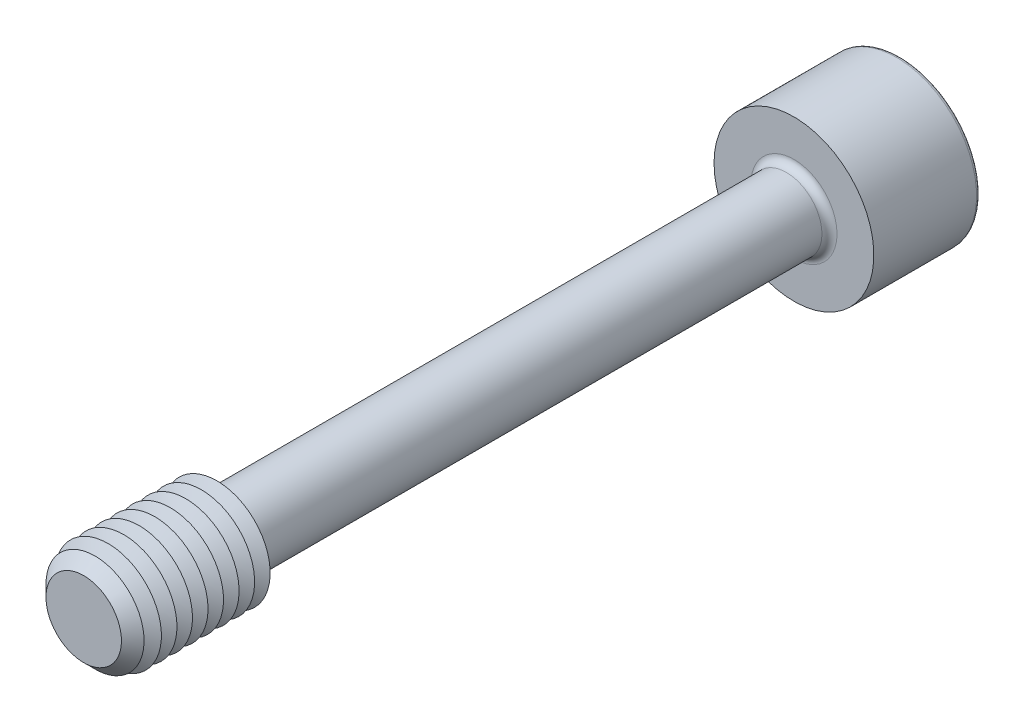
ISO-10303-21;
HEADER;
FILE_DESCRIPTION(('STEP AP214'),'2;1');
FILE_NAME('part.step','',(''),(''),'','','');
FILE_SCHEMA(('AUTOMOTIVE_DESIGN { 1 0 10303 214 1 1 1 1 }'));
ENDSEC;
DATA;
#1=APPLICATION_CONTEXT('core data for automotive mechanical design processes');
#2=APPLICATION_PROTOCOL_DEFINITION('international standard','automotive_design',2000,#1);
#3=PRODUCT_CONTEXT('',#1,'mechanical');
#4=PRODUCT('Part','Part','',(#3));
#5=PRODUCT_RELATED_PRODUCT_CATEGORY('part','',(#4));
#6=PRODUCT_DEFINITION_FORMATION('','',#4);
#7=PRODUCT_DEFINITION_CONTEXT('part definition',#1,'design');
#8=PRODUCT_DEFINITION('design','',#6,#7);
#9=PRODUCT_DEFINITION_SHAPE('','',#8);
#10=(LENGTH_UNIT() NAMED_UNIT(*) SI_UNIT(.MILLI.,.METRE.));
#11=(NAMED_UNIT(*) PLANE_ANGLE_UNIT() SI_UNIT($,.RADIAN.));
#12=(NAMED_UNIT(*) SI_UNIT($,.STERADIAN.) SOLID_ANGLE_UNIT());
#13=UNCERTAINTY_MEASURE_WITH_UNIT(LENGTH_MEASURE(1.E-05),#10,'distance_accuracy_value','');
#14=(GEOMETRIC_REPRESENTATION_CONTEXT(3) GLOBAL_UNCERTAINTY_ASSIGNED_CONTEXT((#13)) GLOBAL_UNIT_ASSIGNED_CONTEXT((#10,
#11,#12)) REPRESENTATION_CONTEXT('',''));
#15=CARTESIAN_POINT('',(0.,0.,0.));
#16=DIRECTION('',(0.,0.,1.));
#17=DIRECTION('',(1.,0.,0.));
#18=AXIS2_PLACEMENT_3D('',#15,#16,#17);
#19=CARTESIAN_POINT('',(-2.88675134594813,-5.,-42.));
#20=DIRECTION('',(0.,0.,1.));
#21=DIRECTION('',(1.,0.,0.));
#22=AXIS2_PLACEMENT_3D('',#19,#20,#21);
#23=PLANE('',#22);
#24=DIRECTION('',(1.,0.,0.));
#25=VECTOR('',#24,1.);
#26=CARTESIAN_POINT('',(-2.88675134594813,-5.,-42.));
#27=LINE('',#26,#25);
#28=CARTESIAN_POINT('',(0.,-5.,-42.));
#29=VERTEX_POINT('',#28);
#30=CARTESIAN_POINT('',(2.88675134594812,-5.,-42.));
#31=VERTEX_POINT('',#30);
#32=EDGE_CURVE('E763',#29,#31,#27,.T.);
#33=ORIENTED_EDGE('',*,*,#32,.F.);
#34=CARTESIAN_POINT('',(0.,0.,-42.));
#35=DIRECTION('',(0.,0.,1.));
#36=DIRECTION('',(0.,-1.,0.));
#37=AXIS2_PLACEMENT_3D('',#34,#35,#36);
#38=CIRCLE('',#37,5.);
#39=CARTESIAN_POINT('',(4.3301270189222,-2.5,-42.));
#40=VERTEX_POINT('',#39);
#41=EDGE_CURVE('E53',#29,#40,#38,.T.);
#42=ORIENTED_EDGE('',*,*,#41,.T.);
#43=DIRECTION('',(0.5,0.866025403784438,0.));
#44=VECTOR('',#43,1.);
#45=CARTESIAN_POINT('',(2.88675134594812,-5.,-42.));
#46=LINE('',#45,#44);
#47=EDGE_CURVE('E750',#31,#40,#46,.T.);
#48=ORIENTED_EDGE('',*,*,#47,.F.);
#49=EDGE_LOOP('',(#33,#42,#48));
#50=FACE_BOUND('',#49,.T.);
#51=ADVANCED_FACE('F41',(#50),#23,.F.);
#52=CARTESIAN_POINT('',(5.77350269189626,0.,-42.));
#53=VERTEX_POINT('',#52);
#54=EDGE_CURVE('E759',#40,#53,#46,.T.);
#55=ORIENTED_EDGE('',*,*,#54,.F.);
#56=CARTESIAN_POINT('',(4.3301270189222,2.50000000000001,-42.));
#57=VERTEX_POINT('',#56);
#58=EDGE_CURVE('E11',#40,#57,#38,.T.);
#59=ORIENTED_EDGE('',*,*,#58,.T.);
#60=DIRECTION('',(-0.5,0.866025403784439,0.));
#61=VECTOR('',#60,1.);
#62=CARTESIAN_POINT('',(5.77350269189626,0.,-42.));
#63=LINE('',#62,#61);
#64=EDGE_CURVE('E749',#53,#57,#63,.T.);
#65=ORIENTED_EDGE('',*,*,#64,.F.);
#66=EDGE_LOOP('',(#55,#59,#65));
#67=FACE_BOUND('',#66,.T.);
#68=ADVANCED_FACE('F133',(#67),#23,.F.);
#69=CARTESIAN_POINT('',(2.88675134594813,5.,-42.));
#70=VERTEX_POINT('',#69);
#71=EDGE_CURVE('E744',#57,#70,#63,.T.);
#72=ORIENTED_EDGE('',*,*,#71,.F.);
#73=CARTESIAN_POINT('',(0.,5.00000000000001,-42.));
#74=VERTEX_POINT('',#73);
#75=EDGE_CURVE('E51',#57,#74,#38,.T.);
#76=ORIENTED_EDGE('',*,*,#75,.T.);
#77=DIRECTION('',(-1.,0.,0.));
#78=VECTOR('',#77,1.);
#79=CARTESIAN_POINT('',(2.88675134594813,5.,-42.));
#80=LINE('',#79,#78);
#81=EDGE_CURVE('E177',#70,#74,#80,.T.);
#82=ORIENTED_EDGE('',*,*,#81,.F.);
#83=EDGE_LOOP('',(#72,#76,#82));
#84=FACE_BOUND('',#83,.T.);
#85=ADVANCED_FACE('F139',(#84),#23,.F.);
#86=CARTESIAN_POINT('',(-2.88675134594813,5.,-42.));
#87=VERTEX_POINT('',#86);
#88=EDGE_CURVE('E754',#74,#87,#80,.T.);
#89=ORIENTED_EDGE('',*,*,#88,.F.);
#90=CARTESIAN_POINT('',(-4.3301270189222,2.50000000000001,-42.));
#91=VERTEX_POINT('',#90);
#92=EDGE_CURVE('E265',#74,#91,#38,.T.);
#93=ORIENTED_EDGE('',*,*,#92,.T.);
#94=DIRECTION('',(-0.5,-0.866025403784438,0.));
#95=VECTOR('',#94,1.);
#96=CARTESIAN_POINT('',(-2.88675134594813,5.,-42.));
#97=LINE('',#96,#95);
#98=EDGE_CURVE('E176',#87,#91,#97,.T.);
#99=ORIENTED_EDGE('',*,*,#98,.F.);
#100=EDGE_LOOP('',(#89,#93,#99));
#101=FACE_BOUND('',#100,.T.);
#102=ADVANCED_FACE('F157',(#101),#23,.F.);
#103=CARTESIAN_POINT('',(-5.77350269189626,0.,-42.));
#104=VERTEX_POINT('',#103);
#105=EDGE_CURVE('E170',#91,#104,#97,.T.);
#106=ORIENTED_EDGE('',*,*,#105,.F.);
#107=CARTESIAN_POINT('',(-4.3301270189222,-2.5,-42.));
#108=VERTEX_POINT('',#107);
#109=EDGE_CURVE('E172',#91,#108,#38,.T.);
#110=ORIENTED_EDGE('',*,*,#109,.T.);
#111=DIRECTION('',(0.5,-0.866025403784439,0.));
#112=VECTOR('',#111,1.);
#113=CARTESIAN_POINT('',(-5.77350269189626,0.,-42.));
#114=LINE('',#113,#112);
#115=EDGE_CURVE('E174',#104,#108,#114,.T.);
#116=ORIENTED_EDGE('',*,*,#115,.F.);
#117=EDGE_LOOP('',(#106,#110,#116));
#118=FACE_BOUND('',#117,.T.);
#119=ADVANCED_FACE('F146',(#118),#23,.F.);
#120=CARTESIAN_POINT('',(0.,0.,-52.));
#121=DIRECTION('',(0.,0.,-1.));
#122=DIRECTION('',(-1.,0.,0.));
#123=AXIS2_PLACEMENT_3D('',#120,#121,#122);
#124=PLANE('',#123);
#125=CARTESIAN_POINT('',(0.,0.,-52.));
#126=DIRECTION('',(0.,0.,-1.));
#127=DIRECTION('',(-1.,0.,0.));
#128=AXIS2_PLACEMENT_3D('',#125,#126,#127);
#129=CIRCLE('',#128,8.575);
#130=CARTESIAN_POINT('',(-8.575,0.,-52.));
#131=VERTEX_POINT('',#130);
#132=EDGE_CURVE('E251',#131,#131,#129,.T.);
#133=ORIENTED_EDGE('',*,*,#132,.T.);
#134=EDGE_LOOP('',(#133));
#135=FACE_BOUND('',#134,.T.);
#136=DIRECTION('',(-0.5,-0.866025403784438,0.));
#137=VECTOR('',#136,1.);
#138=CARTESIAN_POINT('',(-2.88675134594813,5.,-52.));
#139=LINE('',#138,#137);
#140=CARTESIAN_POINT('',(-2.88675134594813,5.,-52.));
#141=VERTEX_POINT('',#140);
#142=CARTESIAN_POINT('',(-5.77350269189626,0.,-52.));
#143=VERTEX_POINT('',#142);
#144=EDGE_CURVE('E212',#141,#143,#139,.T.);
#145=ORIENTED_EDGE('',*,*,#144,.T.);
#146=DIRECTION('',(0.5,-0.866025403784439,0.));
#147=VECTOR('',#146,1.);
#148=CARTESIAN_POINT('',(-5.77350269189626,0.,-52.));
#149=LINE('',#148,#147);
#150=CARTESIAN_POINT('',(-2.88675134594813,-5.,-52.));
#151=VERTEX_POINT('',#150);
#152=EDGE_CURVE('E67',#143,#151,#149,.T.);
#153=ORIENTED_EDGE('',*,*,#152,.T.);
#154=DIRECTION('',(1.,0.,0.));
#155=VECTOR('',#154,1.);
#156=CARTESIAN_POINT('',(-2.88675134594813,-5.,-52.));
#157=LINE('',#156,#155);
#158=CARTESIAN_POINT('',(2.88675134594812,-5.,-52.));
#159=VERTEX_POINT('',#158);
#160=EDGE_CURVE('E196',#151,#159,#157,.T.);
#161=ORIENTED_EDGE('',*,*,#160,.T.);
#162=DIRECTION('',(0.5,0.866025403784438,0.));
#163=VECTOR('',#162,1.);
#164=CARTESIAN_POINT('',(2.88675134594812,-5.,-52.));
#165=LINE('',#164,#163);
#166=CARTESIAN_POINT('',(5.77350269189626,0.,-52.));
#167=VERTEX_POINT('',#166);
#168=EDGE_CURVE('E200',#159,#167,#165,.T.);
#169=ORIENTED_EDGE('',*,*,#168,.T.);
#170=DIRECTION('',(-0.5,0.866025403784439,0.));
#171=VECTOR('',#170,1.);
#172=CARTESIAN_POINT('',(5.77350269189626,0.,-52.));
#173=LINE('',#172,#171);
#174=CARTESIAN_POINT('',(2.88675134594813,5.,-52.));
#175=VERTEX_POINT('',#174);
#176=EDGE_CURVE('E204',#167,#175,#173,.T.);
#177=ORIENTED_EDGE('',*,*,#176,.T.);
#178=DIRECTION('',(-1.,0.,0.));
#179=VECTOR('',#178,1.);
#180=CARTESIAN_POINT('',(2.88675134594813,5.,-52.));
#181=LINE('',#180,#179);
#182=EDGE_CURVE('E208',#175,#141,#181,.T.);
#183=ORIENTED_EDGE('',*,*,#182,.T.);
#184=EDGE_LOOP('',(#145,#153,#161,#169,#177,#183));
#185=FACE_BOUND('',#184,.T.);
#186=ADVANCED_FACE('F156',(#135,#185),#124,.T.);
#187=CARTESIAN_POINT('',(0.,0.,40.));
#188=DIRECTION('',(0.,0.,-1.));
#189=DIRECTION('',(-1.,0.,0.));
#190=AXIS2_PLACEMENT_3D('',#187,#188,#189);
#191=CYLINDRICAL_SURFACE('',#190,4.);
#192=CARTESIAN_POINT('',(0.,0.,-39.15));
#193=DIRECTION('',(0.,0.,-1.));
#194=DIRECTION('',(-1.,0.,0.));
#195=AXIS2_PLACEMENT_3D('',#192,#193,#194);
#196=CIRCLE('',#195,4.);
#197=CARTESIAN_POINT('',(-4.,0.,-39.15));
#198=VERTEX_POINT('',#197);
#199=EDGE_CURVE('E247',#198,#198,#196,.F.);
#200=ORIENTED_EDGE('',*,*,#199,.T.);
#201=EDGE_LOOP('',(#200));
#202=FACE_BOUND('',#201,.T.);
#203=CARTESIAN_POINT('',(0.,0.,23.8452994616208));
#204=DIRECTION('',(0.,0.,-1.));
#205=DIRECTION('',(0.,1.,0.));
#206=AXIS2_PLACEMENT_3D('',#203,#204,#205);
#207=CIRCLE('',#206,4.);
#208=CARTESIAN_POINT('',(0.,4.,23.8452994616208));
#209=VERTEX_POINT('',#208);
#210=EDGE_CURVE('E235',#209,#209,#207,.T.);
#211=ORIENTED_EDGE('',*,*,#210,.T.);
#212=EDGE_LOOP('',(#211));
#213=FACE_BOUND('',#212,.T.);
#214=ADVANCED_FACE('F163',(#202,#213),#191,.T.);
#215=CARTESIAN_POINT('',(0.,0.,23.8452994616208));
#216=DIRECTION('',(0.,0.,1.));
#217=DIRECTION('',(0.,-1.,0.));
#218=AXIS2_PLACEMENT_3D('',#215,#216,#217);
#219=CONICAL_SURFACE('',#218,4.,1.0471975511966);
#220=CARTESIAN_POINT('',(0.,0.,25.));
#221=DIRECTION('',(0.,0.,-1.));
#222=DIRECTION('',(-1.,0.,0.));
#223=AXIS2_PLACEMENT_3D('',#220,#221,#222);
#224=CIRCLE('',#223,6.);
#225=CARTESIAN_POINT('',(-6.,0.,25.));
#226=VERTEX_POINT('',#225);
#227=EDGE_CURVE('E269',#226,#226,#224,.T.);
#228=ORIENTED_EDGE('',*,*,#227,.T.);
#229=EDGE_LOOP('',(#228));
#230=FACE_BOUND('',#229,.T.);
#231=ORIENTED_EDGE('',*,*,#210,.F.);
#232=EDGE_LOOP('',(#231));
#233=FACE_BOUND('',#232,.T.);
#234=ADVANCED_FACE('F513',(#230,#233),#219,.T.);
#235=CARTESIAN_POINT('',(0.,0.,-40.));
#236=DIRECTION('',(0.,0.,-1.));
#237=DIRECTION('',(-1.,0.,0.));
#238=AXIS2_PLACEMENT_3D('',#235,#236,#237);
#239=PLANE('',#238);
#240=CARTESIAN_POINT('',(0.,0.,-40.));
#241=DIRECTION('',(0.,0.,-1.));
#242=DIRECTION('',(-1.,0.,0.));
#243=AXIS2_PLACEMENT_3D('',#240,#241,#242);
#244=CIRCLE('',#243,4.85);
#245=CARTESIAN_POINT('',(-4.85,0.,-40.));
#246=VERTEX_POINT('',#245);
#247=EDGE_CURVE('E243',#246,#246,#244,.T.);
#248=ORIENTED_EDGE('',*,*,#247,.T.);
#249=EDGE_LOOP('',(#248));
#250=FACE_BOUND('',#249,.T.);
#251=CARTESIAN_POINT('',(0.,0.,-40.));
#252=DIRECTION('',(0.,0.,-1.));
#253=DIRECTION('',(-1.,0.,0.));
#254=AXIS2_PLACEMENT_3D('',#251,#252,#253);
#255=CIRCLE('',#254,9.);
#256=CARTESIAN_POINT('',(-9.,0.,-40.));
#257=VERTEX_POINT('',#256);
#258=EDGE_CURVE('E231',#257,#257,#255,.T.);
#259=ORIENTED_EDGE('',*,*,#258,.F.);
#260=EDGE_LOOP('',(#259));
#261=FACE_BOUND('',#260,.T.);
#262=ADVANCED_FACE('F506',(#250,#261),#239,.F.);
#263=CARTESIAN_POINT('',(0.,0.,-52.));
#264=DIRECTION('',(0.,0.,1.));
#265=DIRECTION('',(1.,0.,0.));
#266=AXIS2_PLACEMENT_3D('',#263,#264,#265);
#267=CYLINDRICAL_SURFACE('',#266,9.);
#268=CARTESIAN_POINT('',(0.,0.,-51.575));
#269=DIRECTION('',(0.,0.,-1.));
#270=DIRECTION('',(-1.,0.,0.));
#271=AXIS2_PLACEMENT_3D('',#268,#269,#270);
#272=CIRCLE('',#271,9.);
#273=CARTESIAN_POINT('',(-9.,0.,-51.575));
#274=VERTEX_POINT('',#273);
#275=EDGE_CURVE('E254',#274,#274,#272,.F.);
#276=ORIENTED_EDGE('',*,*,#275,.T.);
#277=EDGE_LOOP('',(#276));
#278=FACE_BOUND('',#277,.T.);
#279=ORIENTED_EDGE('',*,*,#258,.T.);
#280=EDGE_LOOP('',(#279));
#281=FACE_BOUND('',#280,.T.);
#282=ADVANCED_FACE('F512',(#278,#281),#267,.T.);
#283=CARTESIAN_POINT('',(-5.77350269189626,0.,-42.));
#284=DIRECTION('',(0.866025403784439,0.5,0.));
#285=DIRECTION('',(-0.5,0.866025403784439,0.));
#286=AXIS2_PLACEMENT_3D('',#283,#284,#285);
#287=PLANE('',#286);
#288=ORIENTED_EDGE('',*,*,#152,.F.);
#289=DIRECTION('',(0.,0.,-1.));
#290=VECTOR('',#289,1.);
#291=CARTESIAN_POINT('',(-5.77350269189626,0.,-42.));
#292=LINE('',#291,#290);
#293=EDGE_CURVE('E186',#104,#143,#292,.T.);
#294=ORIENTED_EDGE('',*,*,#293,.F.);
#295=ORIENTED_EDGE('',*,*,#115,.T.);
#296=CARTESIAN_POINT('',(-2.88675134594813,-5.,-42.));
#297=VERTEX_POINT('',#296);
#298=EDGE_CURVE('E215',#108,#297,#114,.T.);
#299=ORIENTED_EDGE('',*,*,#298,.T.);
#300=DIRECTION('',(0.,0.,-1.));
#301=VECTOR('',#300,1.);
#302=CARTESIAN_POINT('',(-2.88675134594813,-5.,-42.));
#303=LINE('',#302,#301);
#304=EDGE_CURVE('E228',#297,#151,#303,.T.);
#305=ORIENTED_EDGE('',*,*,#304,.T.);
#306=EDGE_LOOP('',(#288,#294,#295,#299,#305));
#307=FACE_BOUND('',#306,.T.);
#308=ADVANCED_FACE('F524',(#307),#287,.T.);
#309=CARTESIAN_POINT('',(-2.88675134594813,-5.,-42.));
#310=DIRECTION('',(0.,1.,0.));
#311=DIRECTION('',(0.,0.,1.));
#312=AXIS2_PLACEMENT_3D('',#309,#310,#311);
#313=PLANE('',#312);
#314=ORIENTED_EDGE('',*,*,#160,.F.);
#315=ORIENTED_EDGE('',*,*,#304,.F.);
#316=EDGE_CURVE('E760',#297,#29,#27,.T.);
#317=ORIENTED_EDGE('',*,*,#316,.T.);
#318=ORIENTED_EDGE('',*,*,#32,.T.);
#319=DIRECTION('',(0.,0.,-1.));
#320=VECTOR('',#319,1.);
#321=CARTESIAN_POINT('',(2.88675134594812,-5.,-42.));
#322=LINE('',#321,#320);
#323=EDGE_CURVE('E225',#31,#159,#322,.T.);
#324=ORIENTED_EDGE('',*,*,#323,.T.);
#325=EDGE_LOOP('',(#314,#315,#317,#318,#324));
#326=FACE_BOUND('',#325,.T.);
#327=ADVANCED_FACE('F540',(#326),#313,.T.);
#328=CARTESIAN_POINT('',(2.88675134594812,-5.,-42.));
#329=DIRECTION('',(-0.866025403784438,0.5,0.));
#330=DIRECTION('',(-0.5,-0.866025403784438,0.));
#331=AXIS2_PLACEMENT_3D('',#328,#329,#330);
#332=PLANE('',#331);
#333=ORIENTED_EDGE('',*,*,#168,.F.);
#334=ORIENTED_EDGE('',*,*,#323,.F.);
#335=ORIENTED_EDGE('',*,*,#47,.T.);
#336=ORIENTED_EDGE('',*,*,#54,.T.);
#337=DIRECTION('',(0.,0.,-1.));
#338=VECTOR('',#337,1.);
#339=CARTESIAN_POINT('',(5.77350269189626,0.,-42.));
#340=LINE('',#339,#338);
#341=EDGE_CURVE('E222',#53,#167,#340,.T.);
#342=ORIENTED_EDGE('',*,*,#341,.T.);
#343=EDGE_LOOP('',(#333,#334,#335,#336,#342));
#344=FACE_BOUND('',#343,.T.);
#345=ADVANCED_FACE('F550',(#344),#332,.T.);
#346=CARTESIAN_POINT('',(5.77350269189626,0.,-42.));
#347=DIRECTION('',(-0.866025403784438,-0.5,0.));
#348=DIRECTION('',(0.5,-0.866025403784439,0.));
#349=AXIS2_PLACEMENT_3D('',#346,#347,#348);
#350=PLANE('',#349);
#351=ORIENTED_EDGE('',*,*,#176,.F.);
#352=ORIENTED_EDGE('',*,*,#341,.F.);
#353=ORIENTED_EDGE('',*,*,#64,.T.);
#354=ORIENTED_EDGE('',*,*,#71,.T.);
#355=DIRECTION('',(0.,0.,-1.));
#356=VECTOR('',#355,1.);
#357=CARTESIAN_POINT('',(2.88675134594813,5.,-42.));
#358=LINE('',#357,#356);
#359=EDGE_CURVE('E219',#70,#175,#358,.T.);
#360=ORIENTED_EDGE('',*,*,#359,.T.);
#361=EDGE_LOOP('',(#351,#352,#353,#354,#360));
#362=FACE_BOUND('',#361,.T.);
#363=ADVANCED_FACE('F560',(#362),#350,.T.);
#364=CARTESIAN_POINT('',(2.88675134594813,5.,-42.));
#365=DIRECTION('',(0.,-1.,0.));
#366=DIRECTION('',(0.,0.,-1.));
#367=AXIS2_PLACEMENT_3D('',#364,#365,#366);
#368=PLANE('',#367);
#369=ORIENTED_EDGE('',*,*,#182,.F.);
#370=ORIENTED_EDGE('',*,*,#359,.F.);
#371=ORIENTED_EDGE('',*,*,#81,.T.);
#372=ORIENTED_EDGE('',*,*,#88,.T.);
#373=DIRECTION('',(0.,0.,-1.));
#374=VECTOR('',#373,1.);
#375=CARTESIAN_POINT('',(-2.88675134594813,5.,-42.));
#376=LINE('',#375,#374);
#377=EDGE_CURVE('E182',#87,#141,#376,.T.);
#378=ORIENTED_EDGE('',*,*,#377,.T.);
#379=EDGE_LOOP('',(#369,#370,#371,#372,#378));
#380=FACE_BOUND('',#379,.T.);
#381=ADVANCED_FACE('F152',(#380),#368,.T.);
#382=CARTESIAN_POINT('',(-2.88675134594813,5.,-42.));
#383=DIRECTION('',(0.866025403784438,-0.5,0.));
#384=DIRECTION('',(0.5,0.866025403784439,0.));
#385=AXIS2_PLACEMENT_3D('',#382,#383,#384);
#386=PLANE('',#385);
#387=ORIENTED_EDGE('',*,*,#144,.F.);
#388=ORIENTED_EDGE('',*,*,#377,.F.);
#389=ORIENTED_EDGE('',*,*,#98,.T.);
#390=ORIENTED_EDGE('',*,*,#105,.T.);
#391=ORIENTED_EDGE('',*,*,#293,.T.);
#392=EDGE_LOOP('',(#387,#388,#389,#390,#391));
#393=FACE_BOUND('',#392,.T.);
#394=ADVANCED_FACE('F144',(#393),#386,.T.);
#395=ORIENTED_EDGE('',*,*,#298,.F.);
#396=EDGE_CURVE('E257',#108,#29,#38,.T.);
#397=ORIENTED_EDGE('',*,*,#396,.T.);
#398=ORIENTED_EDGE('',*,*,#316,.F.);
#399=EDGE_LOOP('',(#395,#397,#398));
#400=FACE_BOUND('',#399,.T.);
#401=ADVANCED_FACE('F135',(#400),#23,.F.);
#402=CARTESIAN_POINT('',(0.,0.,-39.15));
#403=DIRECTION('',(0.,0.,-1.));
#404=DIRECTION('',(-1.,0.,0.));
#405=AXIS2_PLACEMENT_3D('',#402,#403,#404);
#406=TOROIDAL_SURFACE('',#405,4.85,0.85);
#407=ORIENTED_EDGE('',*,*,#199,.F.);
#408=EDGE_LOOP('',(#407));
#409=FACE_BOUND('',#408,.T.);
#410=ORIENTED_EDGE('',*,*,#247,.F.);
#411=EDGE_LOOP('',(#410));
#412=FACE_BOUND('',#411,.T.);
#413=ADVANCED_FACE('F129',(#409,#412),#406,.F.);
#414=CARTESIAN_POINT('',(0.,0.,-51.575));
#415=DIRECTION('',(0.,0.,-1.));
#416=DIRECTION('',(-1.,0.,0.));
#417=AXIS2_PLACEMENT_3D('',#414,#415,#416);
#418=TOROIDAL_SURFACE('',#417,8.575,0.425);
#419=ORIENTED_EDGE('',*,*,#275,.F.);
#420=EDGE_LOOP('',(#419));
#421=FACE_BOUND('',#420,.T.);
#422=ORIENTED_EDGE('',*,*,#132,.F.);
#423=EDGE_LOOP('',(#422));
#424=FACE_BOUND('',#423,.T.);
#425=ADVANCED_FACE('F43',(#421,#424),#418,.T.);
#426=CARTESIAN_POINT('',(0.,0.,-39.1132486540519));
#427=DIRECTION('',(0.,0.,-1.));
#428=DIRECTION('',(0.,1.,0.));
#429=AXIS2_PLACEMENT_3D('',#426,#427,#428);
#430=CONICAL_SURFACE('',#429,0.,1.0471975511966);
#431=ORIENTED_EDGE('',*,*,#41,.F.);
#432=ORIENTED_EDGE('',*,*,#396,.F.);
#433=ORIENTED_EDGE('',*,*,#109,.F.);
#434=ORIENTED_EDGE('',*,*,#92,.F.);
#435=ORIENTED_EDGE('',*,*,#75,.F.);
#436=ORIENTED_EDGE('',*,*,#58,.F.);
#437=EDGE_LOOP('',(#431,#432,#433,#434,#435,#436));
#438=FACE_BOUND('',#437,.T.);
#439=CARTESIAN_POINT('',(0.,0.,-39.1132486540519));
#440=VERTEX_POINT('',#439);
#441=VERTEX_LOOP('',#440);
#442=FACE_BOUND('',#441,.T.);
#443=ADVANCED_FACE('F118',(#438,#442),#430,.F.);
#444=CARTESIAN_POINT('',(0.,0.,25.875));
#445=DIRECTION('',(0.,0.,-1.));
#446=DIRECTION('',(-1.,0.,0.));
#447=AXIS2_PLACEMENT_3D('',#444,#445,#446);
#448=CONICAL_SURFACE('',#447,4.48445554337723,1.0471975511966);
#449=ORIENTED_EDGE('',*,*,#227,.F.);
#450=EDGE_LOOP('',(#449));
#451=FACE_BOUND('',#450,.T.);
#452=CARTESIAN_POINT('',(0.,0.,25.875));
#453=DIRECTION('',(0.,0.,-1.));
#454=DIRECTION('',(-1.,0.,0.));
#455=AXIS2_PLACEMENT_3D('',#452,#453,#454);
#456=CIRCLE('',#455,4.48445554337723);
#457=CARTESIAN_POINT('',(-4.48445554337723,0.,25.875));
#458=VERTEX_POINT('',#457);
#459=EDGE_CURVE('E275',#458,#458,#456,.T.);
#460=ORIENTED_EDGE('',*,*,#459,.T.);
#461=EDGE_LOOP('',(#460));
#462=FACE_BOUND('',#461,.T.);
#463=ADVANCED_FACE('F120',(#451,#462),#448,.T.);
#464=CARTESIAN_POINT('',(0.,0.,26.75));
#465=DIRECTION('',(0.,0.,1.));
#466=DIRECTION('',(1.,0.,0.));
#467=AXIS2_PLACEMENT_3D('',#464,#465,#466);
#468=CONICAL_SURFACE('',#467,6.,1.0471975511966);
#469=ORIENTED_EDGE('',*,*,#459,.F.);
#470=EDGE_LOOP('',(#469));
#471=FACE_BOUND('',#470,.T.);
#472=CARTESIAN_POINT('',(0.,0.,26.75));
#473=DIRECTION('',(0.,0.,-1.));
#474=DIRECTION('',(-1.,0.,0.));
#475=AXIS2_PLACEMENT_3D('',#472,#473,#474);
#476=CIRCLE('',#475,6.);
#477=CARTESIAN_POINT('',(-6.,0.,26.75));
#478=VERTEX_POINT('',#477);
#479=EDGE_CURVE('E280',#478,#478,#476,.T.);
#480=ORIENTED_EDGE('',*,*,#479,.T.);
#481=EDGE_LOOP('',(#480));
#482=FACE_BOUND('',#481,.T.);
#483=ADVANCED_FACE('F126',(#471,#482),#468,.T.);
#484=CARTESIAN_POINT('',(0.,0.,27.625));
#485=DIRECTION('',(0.,0.,-1.));
#486=DIRECTION('',(-1.,0.,0.));
#487=AXIS2_PLACEMENT_3D('',#484,#485,#486);
#488=CONICAL_SURFACE('',#487,4.48445554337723,1.0471975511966);
#489=ORIENTED_EDGE('',*,*,#479,.F.);
#490=EDGE_LOOP('',(#489));
#491=FACE_BOUND('',#490,.T.);
#492=CARTESIAN_POINT('',(0.,0.,27.625));
#493=DIRECTION('',(0.,0.,-1.));
#494=DIRECTION('',(-1.,0.,0.));
#495=AXIS2_PLACEMENT_3D('',#492,#493,#494);
#496=CIRCLE('',#495,4.48445554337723);
#497=CARTESIAN_POINT('',(-4.48445554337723,0.,27.625));
#498=VERTEX_POINT('',#497);
#499=EDGE_CURVE('E286',#498,#498,#496,.T.);
#500=ORIENTED_EDGE('',*,*,#499,.T.);
#501=EDGE_LOOP('',(#500));
#502=FACE_BOUND('',#501,.T.);
#503=ADVANCED_FACE('F400',(#491,#502),#488,.T.);
#504=CARTESIAN_POINT('',(0.,0.,28.5));
#505=DIRECTION('',(0.,0.,1.));
#506=DIRECTION('',(1.,0.,0.));
#507=AXIS2_PLACEMENT_3D('',#504,#505,#506);
#508=CONICAL_SURFACE('',#507,6.,1.0471975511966);
#509=ORIENTED_EDGE('',*,*,#499,.F.);
#510=EDGE_LOOP('',(#509));
#511=FACE_BOUND('',#510,.T.);
#512=CARTESIAN_POINT('',(0.,0.,28.5));
#513=DIRECTION('',(0.,0.,-1.));
#514=DIRECTION('',(-1.,0.,0.));
#515=AXIS2_PLACEMENT_3D('',#512,#513,#514);
#516=CIRCLE('',#515,6.);
#517=CARTESIAN_POINT('',(-6.,0.,28.5));
#518=VERTEX_POINT('',#517);
#519=EDGE_CURVE('E290',#518,#518,#516,.T.);
#520=ORIENTED_EDGE('',*,*,#519,.T.);
#521=EDGE_LOOP('',(#520));
#522=FACE_BOUND('',#521,.T.);
#523=ADVANCED_FACE('F396',(#511,#522),#508,.T.);
#524=CARTESIAN_POINT('',(0.,0.,29.375));
#525=DIRECTION('',(0.,0.,-1.));
#526=DIRECTION('',(-1.,0.,0.));
#527=AXIS2_PLACEMENT_3D('',#524,#525,#526);
#528=CONICAL_SURFACE('',#527,4.48445554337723,1.0471975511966);
#529=ORIENTED_EDGE('',*,*,#519,.F.);
#530=EDGE_LOOP('',(#529));
#531=FACE_BOUND('',#530,.T.);
#532=CARTESIAN_POINT('',(0.,0.,29.375));
#533=DIRECTION('',(0.,0.,-1.));
#534=DIRECTION('',(-1.,0.,0.));
#535=AXIS2_PLACEMENT_3D('',#532,#533,#534);
#536=CIRCLE('',#535,4.48445554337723);
#537=CARTESIAN_POINT('',(-4.48445554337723,0.,29.375));
#538=VERTEX_POINT('',#537);
#539=EDGE_CURVE('E294',#538,#538,#536,.T.);
#540=ORIENTED_EDGE('',*,*,#539,.T.);
#541=EDGE_LOOP('',(#540));
#542=FACE_BOUND('',#541,.T.);
#543=ADVANCED_FACE('F392',(#531,#542),#528,.T.);
#544=CARTESIAN_POINT('',(0.,0.,30.25));
#545=DIRECTION('',(0.,0.,1.));
#546=DIRECTION('',(1.,0.,0.));
#547=AXIS2_PLACEMENT_3D('',#544,#545,#546);
#548=CONICAL_SURFACE('',#547,6.,1.0471975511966);
#549=ORIENTED_EDGE('',*,*,#539,.F.);
#550=EDGE_LOOP('',(#549));
#551=FACE_BOUND('',#550,.T.);
#552=CARTESIAN_POINT('',(0.,0.,30.25));
#553=DIRECTION('',(0.,0.,-1.));
#554=DIRECTION('',(-1.,0.,0.));
#555=AXIS2_PLACEMENT_3D('',#552,#553,#554);
#556=CIRCLE('',#555,6.);
#557=CARTESIAN_POINT('',(-6.,0.,30.25));
#558=VERTEX_POINT('',#557);
#559=EDGE_CURVE('E298',#558,#558,#556,.T.);
#560=ORIENTED_EDGE('',*,*,#559,.T.);
#561=EDGE_LOOP('',(#560));
#562=FACE_BOUND('',#561,.T.);
#563=ADVANCED_FACE('F388',(#551,#562),#548,.T.);
#564=CARTESIAN_POINT('',(0.,0.,31.125));
#565=DIRECTION('',(0.,0.,-1.));
#566=DIRECTION('',(-1.,0.,0.));
#567=AXIS2_PLACEMENT_3D('',#564,#565,#566);
#568=CONICAL_SURFACE('',#567,4.48445554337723,1.0471975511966);
#569=ORIENTED_EDGE('',*,*,#559,.F.);
#570=EDGE_LOOP('',(#569));
#571=FACE_BOUND('',#570,.T.);
#572=CARTESIAN_POINT('',(0.,0.,31.125));
#573=DIRECTION('',(0.,0.,-1.));
#574=DIRECTION('',(-1.,0.,0.));
#575=AXIS2_PLACEMENT_3D('',#572,#573,#574);
#576=CIRCLE('',#575,4.48445554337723);
#577=CARTESIAN_POINT('',(-4.48445554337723,0.,31.125));
#578=VERTEX_POINT('',#577);
#579=EDGE_CURVE('E302',#578,#578,#576,.T.);
#580=ORIENTED_EDGE('',*,*,#579,.T.);
#581=EDGE_LOOP('',(#580));
#582=FACE_BOUND('',#581,.T.);
#583=ADVANCED_FACE('F384',(#571,#582),#568,.T.);
#584=CARTESIAN_POINT('',(0.,0.,32.));
#585=DIRECTION('',(0.,0.,1.));
#586=DIRECTION('',(1.,0.,0.));
#587=AXIS2_PLACEMENT_3D('',#584,#585,#586);
#588=CONICAL_SURFACE('',#587,6.,1.0471975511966);
#589=ORIENTED_EDGE('',*,*,#579,.F.);
#590=EDGE_LOOP('',(#589));
#591=FACE_BOUND('',#590,.T.);
#592=CARTESIAN_POINT('',(0.,0.,32.));
#593=DIRECTION('',(0.,0.,-1.));
#594=DIRECTION('',(-1.,0.,0.));
#595=AXIS2_PLACEMENT_3D('',#592,#593,#594);
#596=CIRCLE('',#595,6.);
#597=CARTESIAN_POINT('',(-6.,0.,32.));
#598=VERTEX_POINT('',#597);
#599=EDGE_CURVE('E305',#598,#598,#596,.T.);
#600=ORIENTED_EDGE('',*,*,#599,.T.);
#601=EDGE_LOOP('',(#600));
#602=FACE_BOUND('',#601,.T.);
#603=ADVANCED_FACE('F380',(#591,#602),#588,.T.);
#604=CARTESIAN_POINT('',(0.,0.,32.875));
#605=DIRECTION('',(0.,0.,-1.));
#606=DIRECTION('',(-1.,0.,0.));
#607=AXIS2_PLACEMENT_3D('',#604,#605,#606);
#608=CONICAL_SURFACE('',#607,4.48445554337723,1.0471975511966);
#609=ORIENTED_EDGE('',*,*,#599,.F.);
#610=EDGE_LOOP('',(#609));
#611=FACE_BOUND('',#610,.T.);
#612=CARTESIAN_POINT('',(0.,0.,32.875));
#613=DIRECTION('',(0.,0.,-1.));
#614=DIRECTION('',(-1.,0.,0.));
#615=AXIS2_PLACEMENT_3D('',#612,#613,#614);
#616=CIRCLE('',#615,4.48445554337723);
#617=CARTESIAN_POINT('',(-4.48445554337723,0.,32.875));
#618=VERTEX_POINT('',#617);
#619=EDGE_CURVE('E309',#618,#618,#616,.T.);
#620=ORIENTED_EDGE('',*,*,#619,.T.);
#621=EDGE_LOOP('',(#620));
#622=FACE_BOUND('',#621,.T.);
#623=ADVANCED_FACE('F376',(#611,#622),#608,.T.);
#624=CARTESIAN_POINT('',(0.,0.,33.75));
#625=DIRECTION('',(0.,0.,1.));
#626=DIRECTION('',(1.,0.,0.));
#627=AXIS2_PLACEMENT_3D('',#624,#625,#626);
#628=CONICAL_SURFACE('',#627,6.,1.0471975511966);
#629=ORIENTED_EDGE('',*,*,#619,.F.);
#630=EDGE_LOOP('',(#629));
#631=FACE_BOUND('',#630,.T.);
#632=CARTESIAN_POINT('',(0.,0.,33.75));
#633=DIRECTION('',(0.,0.,-1.));
#634=DIRECTION('',(-1.,0.,0.));
#635=AXIS2_PLACEMENT_3D('',#632,#633,#634);
#636=CIRCLE('',#635,6.);
#637=CARTESIAN_POINT('',(-6.,0.,33.75));
#638=VERTEX_POINT('',#637);
#639=EDGE_CURVE('E313',#638,#638,#636,.T.);
#640=ORIENTED_EDGE('',*,*,#639,.T.);
#641=EDGE_LOOP('',(#640));
#642=FACE_BOUND('',#641,.T.);
#643=ADVANCED_FACE('F372',(#631,#642),#628,.T.);
#644=CARTESIAN_POINT('',(0.,0.,34.625));
#645=DIRECTION('',(0.,0.,-1.));
#646=DIRECTION('',(-1.,0.,0.));
#647=AXIS2_PLACEMENT_3D('',#644,#645,#646);
#648=CONICAL_SURFACE('',#647,4.48445554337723,1.0471975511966);
#649=ORIENTED_EDGE('',*,*,#639,.F.);
#650=EDGE_LOOP('',(#649));
#651=FACE_BOUND('',#650,.T.);
#652=CARTESIAN_POINT('',(0.,0.,34.625));
#653=DIRECTION('',(0.,0.,-1.));
#654=DIRECTION('',(-1.,0.,0.));
#655=AXIS2_PLACEMENT_3D('',#652,#653,#654);
#656=CIRCLE('',#655,4.48445554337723);
#657=CARTESIAN_POINT('',(-4.48445554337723,0.,34.625));
#658=VERTEX_POINT('',#657);
#659=EDGE_CURVE('E317',#658,#658,#656,.T.);
#660=ORIENTED_EDGE('',*,*,#659,.T.);
#661=EDGE_LOOP('',(#660));
#662=FACE_BOUND('',#661,.T.);
#663=ADVANCED_FACE('F368',(#651,#662),#648,.T.);
#664=CARTESIAN_POINT('',(0.,0.,35.5));
#665=DIRECTION('',(0.,0.,1.));
#666=DIRECTION('',(1.,0.,0.));
#667=AXIS2_PLACEMENT_3D('',#664,#665,#666);
#668=CONICAL_SURFACE('',#667,6.,1.0471975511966);
#669=ORIENTED_EDGE('',*,*,#659,.F.);
#670=EDGE_LOOP('',(#669));
#671=FACE_BOUND('',#670,.T.);
#672=CARTESIAN_POINT('',(0.,0.,35.5));
#673=DIRECTION('',(0.,0.,-1.));
#674=DIRECTION('',(-1.,0.,0.));
#675=AXIS2_PLACEMENT_3D('',#672,#673,#674);
#676=CIRCLE('',#675,6.);
#677=CARTESIAN_POINT('',(-6.,0.,35.5));
#678=VERTEX_POINT('',#677);
#679=EDGE_CURVE('E321',#678,#678,#676,.T.);
#680=ORIENTED_EDGE('',*,*,#679,.T.);
#681=EDGE_LOOP('',(#680));
#682=FACE_BOUND('',#681,.T.);
#683=ADVANCED_FACE('F364',(#671,#682),#668,.T.);
#684=CARTESIAN_POINT('',(0.,0.,36.375));
#685=DIRECTION('',(0.,0.,-1.));
#686=DIRECTION('',(-1.,0.,0.));
#687=AXIS2_PLACEMENT_3D('',#684,#685,#686);
#688=CONICAL_SURFACE('',#687,4.48445554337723,1.0471975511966);
#689=ORIENTED_EDGE('',*,*,#679,.F.);
#690=EDGE_LOOP('',(#689));
#691=FACE_BOUND('',#690,.T.);
#692=CARTESIAN_POINT('',(0.,0.,36.375));
#693=DIRECTION('',(0.,0.,-1.));
#694=DIRECTION('',(-1.,0.,0.));
#695=AXIS2_PLACEMENT_3D('',#692,#693,#694);
#696=CIRCLE('',#695,4.48445554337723);
#697=CARTESIAN_POINT('',(-4.48445554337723,0.,36.375));
#698=VERTEX_POINT('',#697);
#699=EDGE_CURVE('E325',#698,#698,#696,.T.);
#700=ORIENTED_EDGE('',*,*,#699,.T.);
#701=EDGE_LOOP('',(#700));
#702=FACE_BOUND('',#701,.T.);
#703=ADVANCED_FACE('F360',(#691,#702),#688,.T.);
#704=CARTESIAN_POINT('',(0.,0.,37.25));
#705=DIRECTION('',(0.,0.,1.));
#706=DIRECTION('',(1.,0.,0.));
#707=AXIS2_PLACEMENT_3D('',#704,#705,#706);
#708=CONICAL_SURFACE('',#707,6.,1.0471975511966);
#709=ORIENTED_EDGE('',*,*,#699,.F.);
#710=EDGE_LOOP('',(#709));
#711=FACE_BOUND('',#710,.T.);
#712=CARTESIAN_POINT('',(0.,0.,37.25));
#713=DIRECTION('',(0.,0.,-1.));
#714=DIRECTION('',(-1.,0.,0.));
#715=AXIS2_PLACEMENT_3D('',#712,#713,#714);
#716=CIRCLE('',#715,6.);
#717=CARTESIAN_POINT('',(-6.,0.,37.25));
#718=VERTEX_POINT('',#717);
#719=EDGE_CURVE('E329',#718,#718,#716,.T.);
#720=ORIENTED_EDGE('',*,*,#719,.T.);
#721=EDGE_LOOP('',(#720));
#722=FACE_BOUND('',#721,.T.);
#723=ADVANCED_FACE('F353',(#711,#722),#708,.T.);
#724=CARTESIAN_POINT('',(0.,0.,38.125));
#725=DIRECTION('',(0.,0.,-1.));
#726=DIRECTION('',(-1.,0.,0.));
#727=AXIS2_PLACEMENT_3D('',#724,#725,#726);
#728=CONICAL_SURFACE('',#727,4.48445554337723,1.0471975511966);
#729=ORIENTED_EDGE('',*,*,#719,.F.);
#730=EDGE_LOOP('',(#729));
#731=FACE_BOUND('',#730,.T.);
#732=CARTESIAN_POINT('',(0.,0.,38.125));
#733=DIRECTION('',(0.,0.,-1.));
#734=DIRECTION('',(-1.,0.,0.));
#735=AXIS2_PLACEMENT_3D('',#732,#733,#734);
#736=CIRCLE('',#735,4.48445554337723);
#737=CARTESIAN_POINT('',(-4.48445554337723,0.,38.125));
#738=VERTEX_POINT('',#737);
#739=EDGE_CURVE('E333',#738,#738,#736,.T.);
#740=ORIENTED_EDGE('',*,*,#739,.T.);
#741=EDGE_LOOP('',(#740));
#742=FACE_BOUND('',#741,.T.);
#743=ADVANCED_FACE('F339',(#731,#742),#728,.T.);
#744=CARTESIAN_POINT('',(0.,0.,39.));
#745=DIRECTION('',(0.,0.,1.));
#746=DIRECTION('',(1.,0.,0.));
#747=AXIS2_PLACEMENT_3D('',#744,#745,#746);
#748=CONICAL_SURFACE('',#747,6.,1.0471975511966);
#749=CARTESIAN_POINT('',(0.,0.,38.7254809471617));
#750=DIRECTION('',(0.,0.,1.));
#751=DIRECTION('',(1.,0.,0.));
#752=AXIS2_PLACEMENT_3D('',#749,#750,#751);
#753=CIRCLE('',#752,5.52451905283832);
#754=CARTESIAN_POINT('',(0.,5.52451905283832,38.7254809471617));
#755=VERTEX_POINT('',#754);
#756=EDGE_CURVE('E45',#755,#755,#753,.F.);
#757=ORIENTED_EDGE('',*,*,#756,.T.);
#758=EDGE_LOOP('',(#757));
#759=FACE_BOUND('',#758,.T.);
#760=ORIENTED_EDGE('',*,*,#739,.F.);
#761=EDGE_LOOP('',(#760));
#762=FACE_BOUND('',#761,.T.);
#763=ADVANCED_FACE('F341',(#759,#762),#748,.T.);
#764=CARTESIAN_POINT('',(0.,0.,40.));
#765=DIRECTION('',(0.,0.,1.));
#766=DIRECTION('',(1.,0.,0.));
#767=AXIS2_PLACEMENT_3D('',#764,#765,#766);
#768=PLANE('',#767);
#769=CARTESIAN_POINT('',(0.,0.,40.));
#770=DIRECTION('',(0.,0.,1.));
#771=DIRECTION('',(1.,0.,0.));
#772=AXIS2_PLACEMENT_3D('',#769,#770,#771);
#773=CIRCLE('',#772,4.24999999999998);
#774=CARTESIAN_POINT('',(0.,4.24999999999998,40.));
#775=VERTEX_POINT('',#774);
#776=EDGE_CURVE('E239',#775,#775,#773,.T.);
#777=ORIENTED_EDGE('',*,*,#776,.T.);
#778=EDGE_LOOP('',(#777));
#779=FACE_BOUND('',#778,.T.);
#780=ADVANCED_FACE('F343',(#779),#768,.T.);
#781=CARTESIAN_POINT('',(0.,0.,38.25));
#782=DIRECTION('',(0.,0.,-1.));
#783=DIRECTION('',(0.,1.,0.));
#784=AXIS2_PLACEMENT_3D('',#781,#782,#783);
#785=CONICAL_SURFACE('',#784,6.,0.785398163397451);
#786=CARTESIAN_POINT('',(0.,5.52451905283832,38.7254809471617));
#787=CARTESIAN_POINT('',(0.,5.51124281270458,38.7387571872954));
#788=CARTESIAN_POINT('',(0.,5.49796657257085,38.7520334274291));
#789=CARTESIAN_POINT('',(0.,5.47141409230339,38.7785859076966));
#790=CARTESIAN_POINT('',(0.,5.45813785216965,38.7918621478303));
#791=CARTESIAN_POINT('',(0.,5.43158537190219,38.8184146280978));
#792=CARTESIAN_POINT('',(0.,5.41830913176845,38.8316908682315));
#793=CARTESIAN_POINT('',(0.,5.39175665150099,38.858243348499));
#794=CARTESIAN_POINT('',(0.,5.37848041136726,38.8715195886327));
#795=CARTESIAN_POINT('',(0.,5.35192793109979,38.8980720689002));
#796=CARTESIAN_POINT('',(0.,5.33865169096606,38.9113483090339));
#797=CARTESIAN_POINT('',(0.,5.31209921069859,38.9379007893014));
#798=CARTESIAN_POINT('',(0.,5.29882297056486,38.9511770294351));
#799=CARTESIAN_POINT('',(0.,5.2722704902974,38.9777295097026));
#800=CARTESIAN_POINT('',(0.,5.25899425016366,38.9910057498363));
#801=CARTESIAN_POINT('',(0.,5.2324417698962,39.0175582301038));
#802=CARTESIAN_POINT('',(0.,5.21916552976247,39.0308344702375));
#803=CARTESIAN_POINT('',(0.,5.192613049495,39.057386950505));
#804=CARTESIAN_POINT('',(0.,5.17933680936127,39.0706631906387));
#805=CARTESIAN_POINT('',(0.,5.1527843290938,39.0972156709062));
#806=CARTESIAN_POINT('',(0.,5.13950808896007,39.1104919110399));
#807=CARTESIAN_POINT('',(0.,5.1129556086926,39.1370443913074));
#808=CARTESIAN_POINT('',(0.,5.09967936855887,39.1503206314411));
#809=CARTESIAN_POINT('',(0.,5.07312688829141,39.1768731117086));
#810=CARTESIAN_POINT('',(0.,5.05985064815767,39.1901493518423));
#811=CARTESIAN_POINT('',(0.,5.03329816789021,39.2167018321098));
#812=CARTESIAN_POINT('',(0.,5.02002192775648,39.2299780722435));
#813=CARTESIAN_POINT('',(0.,4.99346944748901,39.256530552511));
#814=CARTESIAN_POINT('',(0.,4.98019320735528,39.2698067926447));
#815=CARTESIAN_POINT('',(0.,4.95364072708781,39.2963592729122));
#816=CARTESIAN_POINT('',(0.,4.94036448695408,39.3096355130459));
#817=CARTESIAN_POINT('',(0.,4.91381200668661,39.3361879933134));
#818=CARTESIAN_POINT('',(0.,4.90053576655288,39.3494642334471));
#819=CARTESIAN_POINT('',(0.,4.87398328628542,39.3760167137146));
#820=CARTESIAN_POINT('',(0.,4.86070704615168,39.3892929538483));
#821=CARTESIAN_POINT('',(0.,4.83415456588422,39.4158454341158));
#822=CARTESIAN_POINT('',(0.,4.82087832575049,39.4291216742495));
#823=CARTESIAN_POINT('',(0.,4.79432584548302,39.455674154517));
#824=CARTESIAN_POINT('',(0.,4.78104960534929,39.4689503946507));
#825=CARTESIAN_POINT('',(0.,4.75449712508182,39.4955028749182));
#826=CARTESIAN_POINT('',(0.,4.74122088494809,39.5087791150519));
#827=CARTESIAN_POINT('',(0.,4.71466840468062,39.5353315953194));
#828=CARTESIAN_POINT('',(0.,4.70139216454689,39.5486078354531));
#829=CARTESIAN_POINT('',(0.,4.67483968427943,39.5751603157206));
#830=CARTESIAN_POINT('',(0.,4.66156344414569,39.5884365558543));
#831=CARTESIAN_POINT('',(0.,4.63501096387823,39.6149890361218));
#832=CARTESIAN_POINT('',(0.,4.6217347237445,39.6282652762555));
#833=CARTESIAN_POINT('',(0.,4.59518224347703,39.654817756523));
#834=CARTESIAN_POINT('',(0.,4.5819060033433,39.6680939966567));
#835=CARTESIAN_POINT('',(0.,4.55535352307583,39.6946464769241));
#836=CARTESIAN_POINT('',(0.,4.5420772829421,39.7079227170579));
#837=CARTESIAN_POINT('',(0.,4.51552480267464,39.7344751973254));
#838=CARTESIAN_POINT('',(0.,4.5022485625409,39.7477514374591));
#839=CARTESIAN_POINT('',(0.,4.47569608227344,39.7743039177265));
#840=CARTESIAN_POINT('',(0.,4.46241984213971,39.7875801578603));
#841=CARTESIAN_POINT('',(0.,4.43586736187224,39.8141326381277));
#842=CARTESIAN_POINT('',(0.,4.42259112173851,39.8274088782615));
#843=CARTESIAN_POINT('',(0.,4.39603864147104,39.8539613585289));
#844=CARTESIAN_POINT('',(0.,4.38276240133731,39.8672375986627));
#845=CARTESIAN_POINT('',(0.,4.35620992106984,39.8937900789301));
#846=CARTESIAN_POINT('',(0.,4.34293368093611,39.9070663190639));
#847=CARTESIAN_POINT('',(0.,4.31638120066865,39.9336187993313));
#848=CARTESIAN_POINT('',(0.,4.30310496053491,39.9468950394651));
#849=CARTESIAN_POINT('',(0.,4.27655248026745,39.9734475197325));
#850=CARTESIAN_POINT('',(0.,4.26327624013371,39.9867237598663));
#851=CARTESIAN_POINT('',(0.,4.24999999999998,40.));
#852=B_SPLINE_CURVE_WITH_KNOTS('',3,(#786,#787,#788,#789,#790,#791,#792,#793,#794,#795,#796,
#797,#798,#799,#800,#801,#802,#803,#804,#805,#806,#807,#808,#809,#810,#811,#812,#813,#814,#815,
#816,#817,#818,#819,#820,#821,#822,#823,#824,#825,#826,#827,#828,#829,#830,#831,#832,#833,#834,
#835,#836,#837,#838,#839,#840,#841,#842,#843,#844,#845,#846,#847,#848,#849,#850,#851),
.UNSPECIFIED.,.F.,.F.,(4,2,2,2,2,2,2,2,2,2,2,2,2,2,2,2,2,2,2,2,2,2,2,2,2,2,2,2,2,2,2,2,4),(0.,
0.0563263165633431,0.112652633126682,0.16897894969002,0.225305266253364,0.281631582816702,
0.337957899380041,0.39428421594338,0.450610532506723,0.506936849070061,0.5632631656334,
0.619589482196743,0.675915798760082,0.73224211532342,0.788568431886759,0.844894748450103,
0.901221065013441,0.957547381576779,1.01387369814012,1.07020001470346,1.1265263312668,
1.18285264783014,1.23917896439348,1.29550528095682,1.35183159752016,1.4081579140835,
1.46448423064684,1.52081054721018,1.57713686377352,1.63346318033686,1.6897894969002,
1.74611581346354,1.80244213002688),.UNSPECIFIED.);
#853=EDGE_CURVE('BSEAM350',#755,#775,#852,.T.);
#854=ORIENTED_EDGE('',*,*,#756,.F.);
#855=ORIENTED_EDGE('',*,*,#776,.F.);
#856=ORIENTED_EDGE('',*,*,#853,.T.);
#857=ORIENTED_EDGE('',*,*,#853,.F.);
#858=EDGE_LOOP('',(#854,#856,#855,#857));
#859=FACE_BOUND('',#858,.T.);
#860=ADVANCED_FACE('F350',(#859),#785,.T.);
#861=CLOSED_SHELL('',(#51,#68,#85,#102,#119,#186,#214,#234,#262,#282,#308,#327,#345,#363,#381,
#394,#401,#413,#425,#443,#463,#483,#503,#523,#543,#563,#583,#603,#623,#643,#663,#683,#703,#723,
#743,#763,#780,#860));
#862=MANIFOLD_SOLID_BREP('B2',#861);
#863=ADVANCED_BREP_SHAPE_REPRESENTATION('',(#18,#862),#14);
#864=SHAPE_DEFINITION_REPRESENTATION(#9,#863);
ENDSEC;
END-ISO-10303-21;
